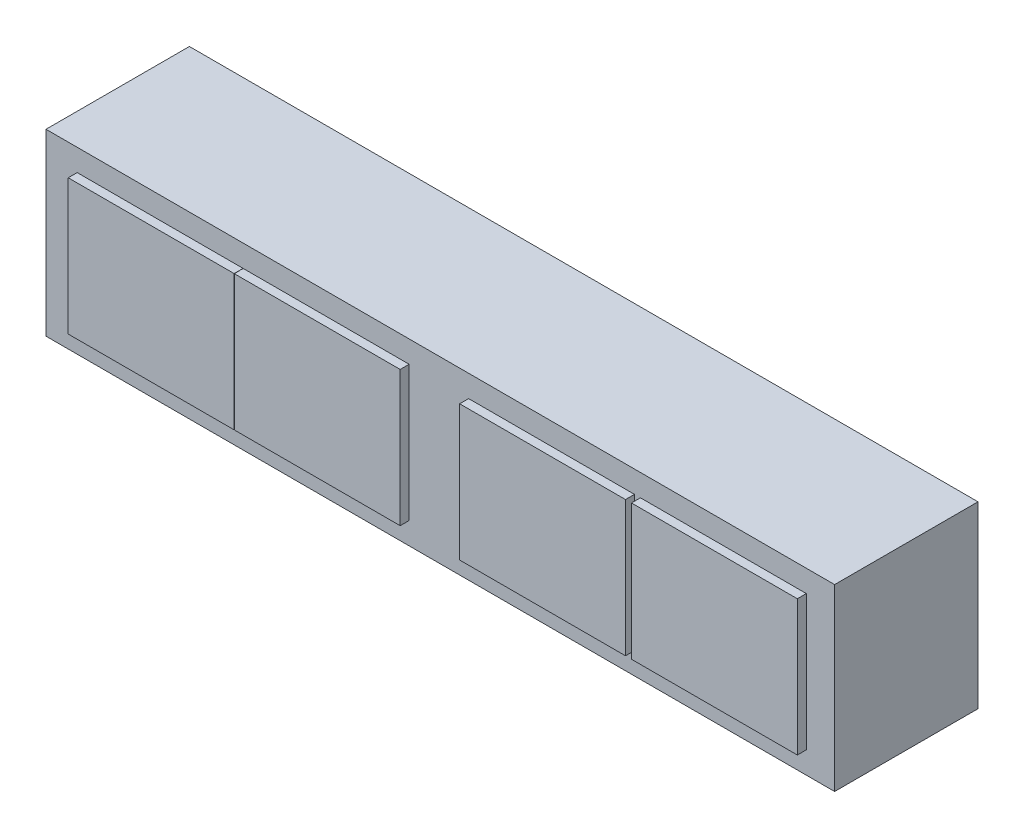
ISO-10303-21;
HEADER;
FILE_DESCRIPTION(('STEP AP214'),'2;1');
FILE_NAME('part.step','',(''),(''),'','','');
FILE_SCHEMA(('AUTOMOTIVE_DESIGN { 1 0 10303 214 1 1 1 1 }'));
ENDSEC;
DATA;
#1=APPLICATION_CONTEXT('core data for automotive mechanical design processes');
#2=APPLICATION_PROTOCOL_DEFINITION('international standard','automotive_design',2000,#1);
#3=PRODUCT_CONTEXT('',#1,'mechanical');
#4=PRODUCT('Part','Part','',(#3));
#5=PRODUCT_RELATED_PRODUCT_CATEGORY('part','',(#4));
#6=PRODUCT_DEFINITION_FORMATION('','',#4);
#7=PRODUCT_DEFINITION_CONTEXT('part definition',#1,'design');
#8=PRODUCT_DEFINITION('design','',#6,#7);
#9=PRODUCT_DEFINITION_SHAPE('','',#8);
#10=(LENGTH_UNIT() NAMED_UNIT(*) SI_UNIT(.MILLI.,.METRE.));
#11=(NAMED_UNIT(*) PLANE_ANGLE_UNIT() SI_UNIT($,.RADIAN.));
#12=(NAMED_UNIT(*) SI_UNIT($,.STERADIAN.) SOLID_ANGLE_UNIT());
#13=UNCERTAINTY_MEASURE_WITH_UNIT(LENGTH_MEASURE(1.E-05),#10,'distance_accuracy_value','');
#14=(GEOMETRIC_REPRESENTATION_CONTEXT(3) GLOBAL_UNCERTAINTY_ASSIGNED_CONTEXT((#13)) GLOBAL_UNIT_ASSIGNED_CONTEXT((#10,
#11,#12)) REPRESENTATION_CONTEXT('',''));
#15=CARTESIAN_POINT('',(0.,0.,0.));
#16=DIRECTION('',(0.,0.,1.));
#17=DIRECTION('',(1.,0.,0.));
#18=AXIS2_PLACEMENT_3D('',#15,#16,#17);
#19=CARTESIAN_POINT('',(0.,381.,304.8));
#20=DIRECTION('',(0.,0.,-1.));
#21=DIRECTION('',(-1.,0.,0.));
#22=AXIS2_PLACEMENT_3D('',#19,#20,#21);
#23=PLANE('',#22);
#24=DIRECTION('',(0.,-1.,0.));
#25=VECTOR('',#24,1.);
#26=CARTESIAN_POINT('',(898.397390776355,334.352318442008,304.8));
#27=LINE('',#26,#25);
#28=CARTESIAN_POINT('',(898.397390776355,334.352318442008,304.8));
#29=VERTEX_POINT('',#28);
#30=CARTESIAN_POINT('',(898.397390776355,46.637208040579,304.8));
#31=VERTEX_POINT('',#30);
#32=EDGE_CURVE('E193',#29,#31,#27,.T.);
#33=ORIENTED_EDGE('',*,*,#32,.F.);
#34=DIRECTION('',(-1.,0.,0.));
#35=VECTOR('',#34,1.);
#36=CARTESIAN_POINT('',(898.397390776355,334.352318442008,304.8));
#37=LINE('',#36,#35);
#38=CARTESIAN_POINT('',(1250.95,334.352318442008,304.8));
#39=VERTEX_POINT('',#38);
#40=EDGE_CURVE('E206',#39,#29,#37,.T.);
#41=ORIENTED_EDGE('',*,*,#40,.F.);
#42=DIRECTION('',(0.,1.,0.));
#43=VECTOR('',#42,1.);
#44=CARTESIAN_POINT('',(1250.95,334.352318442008,304.8));
#45=LINE('',#44,#43);
#46=CARTESIAN_POINT('',(1250.95,46.637208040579,304.8));
#47=VERTEX_POINT('',#46);
#48=EDGE_CURVE('E215',#47,#39,#45,.T.);
#49=ORIENTED_EDGE('',*,*,#48,.F.);
#50=DIRECTION('',(1.,0.,0.));
#51=VECTOR('',#50,1.);
#52=CARTESIAN_POINT('',(898.397390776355,46.637208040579,304.8));
#53=LINE('',#52,#51);
#54=EDGE_CURVE('E196',#31,#47,#53,.T.);
#55=ORIENTED_EDGE('',*,*,#54,.F.);
#56=EDGE_LOOP('',(#33,#41,#49,#55));
#57=FACE_BOUND('',#56,.T.);
#58=DIRECTION('',(0.,-1.,0.));
#59=VECTOR('',#58,1.);
#60=CARTESIAN_POINT('',(419.35,334.352318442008,304.8));
#61=LINE('',#60,#59);
#62=CARTESIAN_POINT('',(419.35,334.352318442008,304.8));
#63=VERTEX_POINT('',#62);
#64=CARTESIAN_POINT('',(419.35,46.637208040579,304.8));
#65=VERTEX_POINT('',#64);
#66=EDGE_CURVE('E264',#63,#65,#61,.T.);
#67=ORIENTED_EDGE('',*,*,#66,.F.);
#68=DIRECTION('',(-1.,0.,0.));
#69=VECTOR('',#68,1.);
#70=CARTESIAN_POINT('',(419.35,334.352318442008,304.8));
#71=LINE('',#70,#69);
#72=CARTESIAN_POINT('',(771.902609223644,334.352318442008,304.8));
#73=VERTEX_POINT('',#72);
#74=EDGE_CURVE('E269',#73,#63,#71,.T.);
#75=ORIENTED_EDGE('',*,*,#74,.F.);
#76=DIRECTION('',(0.,1.,0.));
#77=VECTOR('',#76,1.);
#78=CARTESIAN_POINT('',(771.902609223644,334.352318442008,304.8));
#79=LINE('',#78,#77);
#80=CARTESIAN_POINT('',(771.902609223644,46.637208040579,304.8));
#81=VERTEX_POINT('',#80);
#82=EDGE_CURVE('E281',#81,#73,#79,.T.);
#83=ORIENTED_EDGE('',*,*,#82,.F.);
#84=DIRECTION('',(1.,0.,0.));
#85=VECTOR('',#84,1.);
#86=CARTESIAN_POINT('',(419.35,46.637208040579,304.8));
#87=LINE('',#86,#85);
#88=EDGE_CURVE('E278',#65,#81,#87,.T.);
#89=ORIENTED_EDGE('',*,*,#88,.F.);
#90=EDGE_LOOP('',(#67,#75,#83,#89));
#91=FACE_BOUND('',#90,.T.);
#92=DIRECTION('',(0.,-1.,0.));
#93=VECTOR('',#92,1.);
#94=CARTESIAN_POINT('',(0.,0.,304.8));
#95=LINE('',#94,#93);
#96=CARTESIAN_POINT('',(0.,381.,304.8));
#97=VERTEX_POINT('',#96);
#98=CARTESIAN_POINT('',(0.,0.,304.8));
#99=VERTEX_POINT('',#98);
#100=EDGE_CURVE('E298',#97,#99,#95,.T.);
#101=ORIENTED_EDGE('',*,*,#100,.T.);
#102=DIRECTION('',(1.,0.,0.));
#103=VECTOR('',#102,1.);
#104=CARTESIAN_POINT('',(0.,0.,304.8));
#105=LINE('',#104,#103);
#106=CARTESIAN_POINT('',(1676.4,0.,304.8));
#107=VERTEX_POINT('',#106);
#108=EDGE_CURVE('E301',#99,#107,#105,.T.);
#109=ORIENTED_EDGE('',*,*,#108,.T.);
#110=DIRECTION('',(0.,1.,0.));
#111=VECTOR('',#110,1.);
#112=CARTESIAN_POINT('',(1676.4,0.,304.8));
#113=LINE('',#112,#111);
#114=CARTESIAN_POINT('',(1676.4,381.,304.8));
#115=VERTEX_POINT('',#114);
#116=EDGE_CURVE('E304',#107,#115,#113,.T.);
#117=ORIENTED_EDGE('',*,*,#116,.T.);
#118=DIRECTION('',(-1.,0.,0.));
#119=VECTOR('',#118,1.);
#120=CARTESIAN_POINT('',(0.,381.,304.8));
#121=LINE('',#120,#119);
#122=EDGE_CURVE('E306',#115,#97,#121,.T.);
#123=ORIENTED_EDGE('',*,*,#122,.T.);
#124=EDGE_LOOP('',(#101,#109,#117,#123));
#125=FACE_BOUND('',#124,.T.);
#126=DIRECTION('',(0.,-1.,0.));
#127=VECTOR('',#126,1.);
#128=CARTESIAN_POINT('',(66.2973907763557,334.352318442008,304.8));
#129=LINE('',#128,#127);
#130=CARTESIAN_POINT('',(66.2973907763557,334.352318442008,304.8));
#131=VERTEX_POINT('',#130);
#132=CARTESIAN_POINT('',(66.2973907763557,46.637208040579,304.8));
#133=VERTEX_POINT('',#132);
#134=EDGE_CURVE('E231',#131,#133,#129,.T.);
#135=ORIENTED_EDGE('',*,*,#134,.F.);
#136=DIRECTION('',(-1.,0.,0.));
#137=VECTOR('',#136,1.);
#138=CARTESIAN_POINT('',(66.2973907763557,334.352318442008,304.8));
#139=LINE('',#138,#137);
#140=CARTESIAN_POINT('',(418.85,334.352318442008,304.8));
#141=VERTEX_POINT('',#140);
#142=EDGE_CURVE('E236',#141,#131,#139,.T.);
#143=ORIENTED_EDGE('',*,*,#142,.F.);
#144=DIRECTION('',(0.,1.,0.));
#145=VECTOR('',#144,1.);
#146=CARTESIAN_POINT('',(418.85,334.352318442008,304.8));
#147=LINE('',#146,#145);
#148=CARTESIAN_POINT('',(418.85,46.637208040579,304.8));
#149=VERTEX_POINT('',#148);
#150=EDGE_CURVE('E248',#149,#141,#147,.T.);
#151=ORIENTED_EDGE('',*,*,#150,.F.);
#152=DIRECTION('',(1.,0.,0.));
#153=VECTOR('',#152,1.);
#154=CARTESIAN_POINT('',(66.2973907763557,46.637208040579,304.8));
#155=LINE('',#154,#153);
#156=EDGE_CURVE('E245',#133,#149,#155,.T.);
#157=ORIENTED_EDGE('',*,*,#156,.F.);
#158=EDGE_LOOP('',(#135,#143,#151,#157));
#159=FACE_BOUND('',#158,.T.);
#160=DIRECTION('',(0.,-1.,0.));
#161=VECTOR('',#160,1.);
#162=CARTESIAN_POINT('',(1263.65,334.352318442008,304.8));
#163=LINE('',#162,#161);
#164=CARTESIAN_POINT('',(1263.65,334.352318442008,304.8));
#165=VERTEX_POINT('',#164);
#166=CARTESIAN_POINT('',(1263.65,46.637208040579,304.8));
#167=VERTEX_POINT('',#166);
#168=EDGE_CURVE('E192',#165,#167,#163,.T.);
#169=ORIENTED_EDGE('',*,*,#168,.F.);
#170=DIRECTION('',(-1.,0.,0.));
#171=VECTOR('',#170,1.);
#172=CARTESIAN_POINT('',(1263.65,334.352318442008,304.8));
#173=LINE('',#172,#171);
#174=CARTESIAN_POINT('',(1616.20260922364,334.352318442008,304.8));
#175=VERTEX_POINT('',#174);
#176=EDGE_CURVE('E189',#175,#165,#173,.T.);
#177=ORIENTED_EDGE('',*,*,#176,.F.);
#178=DIRECTION('',(0.,1.,0.));
#179=VECTOR('',#178,1.);
#180=CARTESIAN_POINT('',(1616.20260922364,334.352318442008,304.8));
#181=LINE('',#180,#179);
#182=CARTESIAN_POINT('',(1616.20260922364,46.637208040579,304.8));
#183=VERTEX_POINT('',#182);
#184=EDGE_CURVE('E55',#183,#175,#181,.T.);
#185=ORIENTED_EDGE('',*,*,#184,.F.);
#186=DIRECTION('',(1.,0.,0.));
#187=VECTOR('',#186,1.);
#188=CARTESIAN_POINT('',(1263.65,46.637208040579,304.8));
#189=LINE('',#188,#187);
#190=EDGE_CURVE('E50',#167,#183,#189,.T.);
#191=ORIENTED_EDGE('',*,*,#190,.F.);
#192=EDGE_LOOP('',(#169,#177,#185,#191));
#193=FACE_BOUND('',#192,.T.);
#194=ADVANCED_FACE('F35',(#57,#91,#125,#159,#193),#23,.F.);
#195=CARTESIAN_POINT('',(0.,0.,304.8));
#196=DIRECTION('',(1.,0.,0.));
#197=DIRECTION('',(0.,0.,-1.));
#198=AXIS2_PLACEMENT_3D('',#195,#196,#197);
#199=PLANE('',#198);
#200=DIRECTION('',(0.,-1.,0.));
#201=VECTOR('',#200,1.);
#202=CARTESIAN_POINT('',(0.,0.,0.));
#203=LINE('',#202,#201);
#204=CARTESIAN_POINT('',(0.,381.,0.));
#205=VERTEX_POINT('',#204);
#206=CARTESIAN_POINT('',(0.,0.,0.));
#207=VERTEX_POINT('',#206);
#208=EDGE_CURVE('E297',#205,#207,#203,.T.);
#209=ORIENTED_EDGE('',*,*,#208,.T.);
#210=DIRECTION('',(0.,0.,-1.));
#211=VECTOR('',#210,1.);
#212=CARTESIAN_POINT('',(0.,0.,304.8));
#213=LINE('',#212,#211);
#214=EDGE_CURVE('E11',#99,#207,#213,.T.);
#215=ORIENTED_EDGE('',*,*,#214,.F.);
#216=ORIENTED_EDGE('',*,*,#100,.F.);
#217=DIRECTION('',(0.,0.,-1.));
#218=VECTOR('',#217,1.);
#219=CARTESIAN_POINT('',(0.,381.,304.8));
#220=LINE('',#219,#218);
#221=EDGE_CURVE('E308',#97,#205,#220,.T.);
#222=ORIENTED_EDGE('',*,*,#221,.T.);
#223=EDGE_LOOP('',(#209,#215,#216,#222));
#224=FACE_BOUND('',#223,.T.);
#225=ADVANCED_FACE('F37',(#224),#199,.F.);
#226=CARTESIAN_POINT('',(0.,0.,304.8));
#227=DIRECTION('',(0.,1.,0.));
#228=DIRECTION('',(0.,0.,1.));
#229=AXIS2_PLACEMENT_3D('',#226,#227,#228);
#230=PLANE('',#229);
#231=DIRECTION('',(1.,0.,0.));
#232=VECTOR('',#231,1.);
#233=CARTESIAN_POINT('',(0.,0.,0.));
#234=LINE('',#233,#232);
#235=CARTESIAN_POINT('',(1676.4,0.,0.));
#236=VERTEX_POINT('',#235);
#237=EDGE_CURVE('E311',#207,#236,#234,.T.);
#238=ORIENTED_EDGE('',*,*,#237,.T.);
#239=DIRECTION('',(0.,0.,-1.));
#240=VECTOR('',#239,1.);
#241=CARTESIAN_POINT('',(1676.4,0.,304.8));
#242=LINE('',#241,#240);
#243=EDGE_CURVE('E43',#107,#236,#242,.T.);
#244=ORIENTED_EDGE('',*,*,#243,.F.);
#245=ORIENTED_EDGE('',*,*,#108,.F.);
#246=ORIENTED_EDGE('',*,*,#214,.T.);
#247=EDGE_LOOP('',(#238,#244,#245,#246));
#248=FACE_BOUND('',#247,.T.);
#249=ADVANCED_FACE('F341',(#248),#230,.F.);
#250=CARTESIAN_POINT('',(1676.4,0.,304.8));
#251=DIRECTION('',(-1.,0.,0.));
#252=DIRECTION('',(0.,0.,1.));
#253=AXIS2_PLACEMENT_3D('',#250,#251,#252);
#254=PLANE('',#253);
#255=DIRECTION('',(0.,1.,0.));
#256=VECTOR('',#255,1.);
#257=CARTESIAN_POINT('',(1676.4,0.,0.));
#258=LINE('',#257,#256);
#259=CARTESIAN_POINT('',(1676.4,381.,0.));
#260=VERTEX_POINT('',#259);
#261=EDGE_CURVE('E313',#236,#260,#258,.T.);
#262=ORIENTED_EDGE('',*,*,#261,.T.);
#263=DIRECTION('',(0.,0.,-1.));
#264=VECTOR('',#263,1.);
#265=CARTESIAN_POINT('',(1676.4,381.,304.8));
#266=LINE('',#265,#264);
#267=EDGE_CURVE('E318',#115,#260,#266,.T.);
#268=ORIENTED_EDGE('',*,*,#267,.F.);
#269=ORIENTED_EDGE('',*,*,#116,.F.);
#270=ORIENTED_EDGE('',*,*,#243,.T.);
#271=EDGE_LOOP('',(#262,#268,#269,#270));
#272=FACE_BOUND('',#271,.T.);
#273=ADVANCED_FACE('F325',(#272),#254,.F.);
#274=CARTESIAN_POINT('',(0.,381.,304.8));
#275=DIRECTION('',(0.,-1.,0.));
#276=DIRECTION('',(0.,0.,-1.));
#277=AXIS2_PLACEMENT_3D('',#274,#275,#276);
#278=PLANE('',#277);
#279=DIRECTION('',(-1.,0.,0.));
#280=VECTOR('',#279,1.);
#281=CARTESIAN_POINT('',(0.,381.,0.));
#282=LINE('',#281,#280);
#283=EDGE_CURVE('E302',#260,#205,#282,.T.);
#284=ORIENTED_EDGE('',*,*,#283,.T.);
#285=ORIENTED_EDGE('',*,*,#221,.F.);
#286=ORIENTED_EDGE('',*,*,#122,.F.);
#287=ORIENTED_EDGE('',*,*,#267,.T.);
#288=EDGE_LOOP('',(#284,#285,#286,#287));
#289=FACE_BOUND('',#288,.T.);
#290=ADVANCED_FACE('F334',(#289),#278,.F.);
#291=CARTESIAN_POINT('',(0.,381.,0.));
#292=DIRECTION('',(0.,0.,-1.));
#293=DIRECTION('',(-1.,0.,0.));
#294=AXIS2_PLACEMENT_3D('',#291,#292,#293);
#295=PLANE('',#294);
#296=ORIENTED_EDGE('',*,*,#208,.F.);
#297=ORIENTED_EDGE('',*,*,#283,.F.);
#298=ORIENTED_EDGE('',*,*,#261,.F.);
#299=ORIENTED_EDGE('',*,*,#237,.F.);
#300=EDGE_LOOP('',(#296,#297,#298,#299));
#301=FACE_BOUND('',#300,.T.);
#302=ADVANCED_FACE('F331',(#301),#295,.T.);
#303=CARTESIAN_POINT('',(419.35,334.352318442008,323.85));
#304=DIRECTION('',(1.,0.,0.));
#305=DIRECTION('',(0.,0.,-1.));
#306=AXIS2_PLACEMENT_3D('',#303,#304,#305);
#307=PLANE('',#306);
#308=ORIENTED_EDGE('',*,*,#66,.T.);
#309=DIRECTION('',(0.,0.,-1.));
#310=VECTOR('',#309,1.);
#311=CARTESIAN_POINT('',(419.35,46.637208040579,323.85));
#312=LINE('',#311,#310);
#313=CARTESIAN_POINT('',(419.35,46.637208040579,323.85));
#314=VERTEX_POINT('',#313);
#315=EDGE_CURVE('E294',#314,#65,#312,.T.);
#316=ORIENTED_EDGE('',*,*,#315,.F.);
#317=DIRECTION('',(0.,-1.,0.));
#318=VECTOR('',#317,1.);
#319=CARTESIAN_POINT('',(419.35,334.352318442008,323.85));
#320=LINE('',#319,#318);
#321=CARTESIAN_POINT('',(419.35,334.352318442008,323.85));
#322=VERTEX_POINT('',#321);
#323=EDGE_CURVE('E265',#322,#314,#320,.T.);
#324=ORIENTED_EDGE('',*,*,#323,.F.);
#325=DIRECTION('',(0.,0.,-1.));
#326=VECTOR('',#325,1.);
#327=CARTESIAN_POINT('',(419.35,334.352318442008,323.85));
#328=LINE('',#327,#326);
#329=EDGE_CURVE('E275',#322,#63,#328,.T.);
#330=ORIENTED_EDGE('',*,*,#329,.T.);
#331=EDGE_LOOP('',(#308,#316,#324,#330));
#332=FACE_BOUND('',#331,.T.);
#333=ADVANCED_FACE('F356',(#332),#307,.F.);
#334=CARTESIAN_POINT('',(419.35,46.637208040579,323.85));
#335=DIRECTION('',(0.,1.,0.));
#336=DIRECTION('',(0.,0.,1.));
#337=AXIS2_PLACEMENT_3D('',#334,#335,#336);
#338=PLANE('',#337);
#339=ORIENTED_EDGE('',*,*,#88,.T.);
#340=DIRECTION('',(0.,0.,-1.));
#341=VECTOR('',#340,1.);
#342=CARTESIAN_POINT('',(771.902609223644,46.637208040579,323.85));
#343=LINE('',#342,#341);
#344=CARTESIAN_POINT('',(771.902609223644,46.637208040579,323.85));
#345=VERTEX_POINT('',#344);
#346=EDGE_CURVE('E291',#345,#81,#343,.T.);
#347=ORIENTED_EDGE('',*,*,#346,.F.);
#348=DIRECTION('',(1.,0.,0.));
#349=VECTOR('',#348,1.);
#350=CARTESIAN_POINT('',(419.35,46.637208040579,323.85));
#351=LINE('',#350,#349);
#352=EDGE_CURVE('E268',#314,#345,#351,.T.);
#353=ORIENTED_EDGE('',*,*,#352,.F.);
#354=ORIENTED_EDGE('',*,*,#315,.T.);
#355=EDGE_LOOP('',(#339,#347,#353,#354));
#356=FACE_BOUND('',#355,.T.);
#357=ADVANCED_FACE('F376',(#356),#338,.F.);
#358=CARTESIAN_POINT('',(771.902609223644,334.352318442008,323.85));
#359=DIRECTION('',(-1.,0.,0.));
#360=DIRECTION('',(0.,0.,1.));
#361=AXIS2_PLACEMENT_3D('',#358,#359,#360);
#362=PLANE('',#361);
#363=ORIENTED_EDGE('',*,*,#82,.T.);
#364=DIRECTION('',(0.,0.,-1.));
#365=VECTOR('',#364,1.);
#366=CARTESIAN_POINT('',(771.902609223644,334.352318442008,323.85));
#367=LINE('',#366,#365);
#368=CARTESIAN_POINT('',(771.902609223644,334.352318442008,323.85));
#369=VERTEX_POINT('',#368);
#370=EDGE_CURVE('E288',#369,#73,#367,.T.);
#371=ORIENTED_EDGE('',*,*,#370,.F.);
#372=DIRECTION('',(0.,1.,0.));
#373=VECTOR('',#372,1.);
#374=CARTESIAN_POINT('',(771.902609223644,334.352318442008,323.85));
#375=LINE('',#374,#373);
#376=EDGE_CURVE('E271',#345,#369,#375,.T.);
#377=ORIENTED_EDGE('',*,*,#376,.F.);
#378=ORIENTED_EDGE('',*,*,#346,.T.);
#379=EDGE_LOOP('',(#363,#371,#377,#378));
#380=FACE_BOUND('',#379,.T.);
#381=ADVANCED_FACE('F383',(#380),#362,.F.);
#382=CARTESIAN_POINT('',(419.35,334.352318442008,323.85));
#383=DIRECTION('',(0.,-1.,0.));
#384=DIRECTION('',(0.,0.,-1.));
#385=AXIS2_PLACEMENT_3D('',#382,#383,#384);
#386=PLANE('',#385);
#387=ORIENTED_EDGE('',*,*,#74,.T.);
#388=ORIENTED_EDGE('',*,*,#329,.F.);
#389=DIRECTION('',(-1.,0.,0.));
#390=VECTOR('',#389,1.);
#391=CARTESIAN_POINT('',(419.35,334.352318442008,323.85));
#392=LINE('',#391,#390);
#393=EDGE_CURVE('E273',#369,#322,#392,.T.);
#394=ORIENTED_EDGE('',*,*,#393,.F.);
#395=ORIENTED_EDGE('',*,*,#370,.T.);
#396=EDGE_LOOP('',(#387,#388,#394,#395));
#397=FACE_BOUND('',#396,.T.);
#398=ADVANCED_FACE('F390',(#397),#386,.F.);
#399=CARTESIAN_POINT('',(419.35,46.637208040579,323.85));
#400=DIRECTION('',(0.,0.,1.));
#401=DIRECTION('',(1.,0.,0.));
#402=AXIS2_PLACEMENT_3D('',#399,#400,#401);
#403=PLANE('',#402);
#404=ORIENTED_EDGE('',*,*,#323,.T.);
#405=ORIENTED_EDGE('',*,*,#352,.T.);
#406=ORIENTED_EDGE('',*,*,#376,.T.);
#407=ORIENTED_EDGE('',*,*,#393,.T.);
#408=EDGE_LOOP('',(#404,#405,#406,#407));
#409=FACE_BOUND('',#408,.T.);
#410=ADVANCED_FACE('F398',(#409),#403,.T.);
#411=CARTESIAN_POINT('',(66.2973907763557,334.352318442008,323.85));
#412=DIRECTION('',(1.,0.,0.));
#413=DIRECTION('',(0.,0.,-1.));
#414=AXIS2_PLACEMENT_3D('',#411,#412,#413);
#415=PLANE('',#414);
#416=ORIENTED_EDGE('',*,*,#134,.T.);
#417=DIRECTION('',(0.,0.,-1.));
#418=VECTOR('',#417,1.);
#419=CARTESIAN_POINT('',(66.2973907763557,46.637208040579,323.85));
#420=LINE('',#419,#418);
#421=CARTESIAN_POINT('',(66.2973907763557,46.637208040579,323.85));
#422=VERTEX_POINT('',#421);
#423=EDGE_CURVE('E261',#422,#133,#420,.T.);
#424=ORIENTED_EDGE('',*,*,#423,.F.);
#425=DIRECTION('',(0.,-1.,0.));
#426=VECTOR('',#425,1.);
#427=CARTESIAN_POINT('',(66.2973907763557,334.352318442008,323.85));
#428=LINE('',#427,#426);
#429=CARTESIAN_POINT('',(66.2973907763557,334.352318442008,323.85));
#430=VERTEX_POINT('',#429);
#431=EDGE_CURVE('E232',#430,#422,#428,.T.);
#432=ORIENTED_EDGE('',*,*,#431,.F.);
#433=DIRECTION('',(0.,0.,-1.));
#434=VECTOR('',#433,1.);
#435=CARTESIAN_POINT('',(66.2973907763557,334.352318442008,323.85));
#436=LINE('',#435,#434);
#437=EDGE_CURVE('E242',#430,#131,#436,.T.);
#438=ORIENTED_EDGE('',*,*,#437,.T.);
#439=EDGE_LOOP('',(#416,#424,#432,#438));
#440=FACE_BOUND('',#439,.T.);
#441=ADVANCED_FACE('F406',(#440),#415,.F.);
#442=CARTESIAN_POINT('',(66.2973907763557,46.637208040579,323.85));
#443=DIRECTION('',(0.,1.,0.));
#444=DIRECTION('',(0.,0.,1.));
#445=AXIS2_PLACEMENT_3D('',#442,#443,#444);
#446=PLANE('',#445);
#447=ORIENTED_EDGE('',*,*,#156,.T.);
#448=DIRECTION('',(0.,0.,-1.));
#449=VECTOR('',#448,1.);
#450=CARTESIAN_POINT('',(418.85,46.637208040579,323.85));
#451=LINE('',#450,#449);
#452=CARTESIAN_POINT('',(418.85,46.637208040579,323.85));
#453=VERTEX_POINT('',#452);
#454=EDGE_CURVE('E258',#453,#149,#451,.T.);
#455=ORIENTED_EDGE('',*,*,#454,.F.);
#456=DIRECTION('',(1.,0.,0.));
#457=VECTOR('',#456,1.);
#458=CARTESIAN_POINT('',(66.2973907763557,46.637208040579,323.85));
#459=LINE('',#458,#457);
#460=EDGE_CURVE('E235',#422,#453,#459,.T.);
#461=ORIENTED_EDGE('',*,*,#460,.F.);
#462=ORIENTED_EDGE('',*,*,#423,.T.);
#463=EDGE_LOOP('',(#447,#455,#461,#462));
#464=FACE_BOUND('',#463,.T.);
#465=ADVANCED_FACE('F414',(#464),#446,.F.);
#466=CARTESIAN_POINT('',(418.85,334.352318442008,323.85));
#467=DIRECTION('',(-1.,0.,0.));
#468=DIRECTION('',(0.,0.,1.));
#469=AXIS2_PLACEMENT_3D('',#466,#467,#468);
#470=PLANE('',#469);
#471=ORIENTED_EDGE('',*,*,#150,.T.);
#472=DIRECTION('',(0.,0.,-1.));
#473=VECTOR('',#472,1.);
#474=CARTESIAN_POINT('',(418.85,334.352318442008,323.85));
#475=LINE('',#474,#473);
#476=CARTESIAN_POINT('',(418.85,334.352318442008,323.85));
#477=VERTEX_POINT('',#476);
#478=EDGE_CURVE('E255',#477,#141,#475,.T.);
#479=ORIENTED_EDGE('',*,*,#478,.F.);
#480=DIRECTION('',(0.,1.,0.));
#481=VECTOR('',#480,1.);
#482=CARTESIAN_POINT('',(418.85,334.352318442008,323.85));
#483=LINE('',#482,#481);
#484=EDGE_CURVE('E238',#453,#477,#483,.T.);
#485=ORIENTED_EDGE('',*,*,#484,.F.);
#486=ORIENTED_EDGE('',*,*,#454,.T.);
#487=EDGE_LOOP('',(#471,#479,#485,#486));
#488=FACE_BOUND('',#487,.T.);
#489=ADVANCED_FACE('F422',(#488),#470,.F.);
#490=CARTESIAN_POINT('',(66.2973907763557,334.352318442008,323.85));
#491=DIRECTION('',(0.,-1.,0.));
#492=DIRECTION('',(0.,0.,-1.));
#493=AXIS2_PLACEMENT_3D('',#490,#491,#492);
#494=PLANE('',#493);
#495=ORIENTED_EDGE('',*,*,#142,.T.);
#496=ORIENTED_EDGE('',*,*,#437,.F.);
#497=DIRECTION('',(-1.,0.,0.));
#498=VECTOR('',#497,1.);
#499=CARTESIAN_POINT('',(66.2973907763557,334.352318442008,323.85));
#500=LINE('',#499,#498);
#501=EDGE_CURVE('E240',#477,#430,#500,.T.);
#502=ORIENTED_EDGE('',*,*,#501,.F.);
#503=ORIENTED_EDGE('',*,*,#478,.T.);
#504=EDGE_LOOP('',(#495,#496,#502,#503));
#505=FACE_BOUND('',#504,.T.);
#506=ADVANCED_FACE('F430',(#505),#494,.F.);
#507=CARTESIAN_POINT('',(66.2973907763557,46.637208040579,323.85));
#508=DIRECTION('',(0.,0.,1.));
#509=DIRECTION('',(1.,0.,0.));
#510=AXIS2_PLACEMENT_3D('',#507,#508,#509);
#511=PLANE('',#510);
#512=ORIENTED_EDGE('',*,*,#431,.T.);
#513=ORIENTED_EDGE('',*,*,#460,.T.);
#514=ORIENTED_EDGE('',*,*,#484,.T.);
#515=ORIENTED_EDGE('',*,*,#501,.T.);
#516=EDGE_LOOP('',(#512,#513,#514,#515));
#517=FACE_BOUND('',#516,.T.);
#518=ADVANCED_FACE('F438',(#517),#511,.T.);
#519=CARTESIAN_POINT('',(898.397390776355,334.352318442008,323.85));
#520=DIRECTION('',(1.,0.,0.));
#521=DIRECTION('',(0.,0.,-1.));
#522=AXIS2_PLACEMENT_3D('',#519,#520,#521);
#523=PLANE('',#522);
#524=ORIENTED_EDGE('',*,*,#32,.T.);
#525=DIRECTION('',(0.,0.,-1.));
#526=VECTOR('',#525,1.);
#527=CARTESIAN_POINT('',(898.397390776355,46.637208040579,323.85));
#528=LINE('',#527,#526);
#529=CARTESIAN_POINT('',(898.397390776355,46.637208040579,323.85));
#530=VERTEX_POINT('',#529);
#531=EDGE_CURVE('E228',#530,#31,#528,.T.);
#532=ORIENTED_EDGE('',*,*,#531,.F.);
#533=DIRECTION('',(0.,-1.,0.));
#534=VECTOR('',#533,1.);
#535=CARTESIAN_POINT('',(898.397390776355,334.352318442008,323.85));
#536=LINE('',#535,#534);
#537=CARTESIAN_POINT('',(898.397390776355,334.352318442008,323.85));
#538=VERTEX_POINT('',#537);
#539=EDGE_CURVE('E202',#538,#530,#536,.T.);
#540=ORIENTED_EDGE('',*,*,#539,.F.);
#541=DIRECTION('',(0.,0.,-1.));
#542=VECTOR('',#541,1.);
#543=CARTESIAN_POINT('',(898.397390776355,334.352318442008,323.85));
#544=LINE('',#543,#542);
#545=EDGE_CURVE('E211',#538,#29,#544,.T.);
#546=ORIENTED_EDGE('',*,*,#545,.T.);
#547=EDGE_LOOP('',(#524,#532,#540,#546));
#548=FACE_BOUND('',#547,.T.);
#549=ADVANCED_FACE('F446',(#548),#523,.F.);
#550=CARTESIAN_POINT('',(898.397390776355,46.637208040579,323.85));
#551=DIRECTION('',(0.,1.,0.));
#552=DIRECTION('',(0.,0.,1.));
#553=AXIS2_PLACEMENT_3D('',#550,#551,#552);
#554=PLANE('',#553);
#555=ORIENTED_EDGE('',*,*,#54,.T.);
#556=DIRECTION('',(0.,0.,-1.));
#557=VECTOR('',#556,1.);
#558=CARTESIAN_POINT('',(1250.95,46.637208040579,323.85));
#559=LINE('',#558,#557);
#560=CARTESIAN_POINT('',(1250.95,46.637208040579,323.85));
#561=VERTEX_POINT('',#560);
#562=EDGE_CURVE('E225',#561,#47,#559,.T.);
#563=ORIENTED_EDGE('',*,*,#562,.F.);
#564=DIRECTION('',(1.,0.,0.));
#565=VECTOR('',#564,1.);
#566=CARTESIAN_POINT('',(898.397390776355,46.637208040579,323.85));
#567=LINE('',#566,#565);
#568=EDGE_CURVE('E205',#530,#561,#567,.T.);
#569=ORIENTED_EDGE('',*,*,#568,.F.);
#570=ORIENTED_EDGE('',*,*,#531,.T.);
#571=EDGE_LOOP('',(#555,#563,#569,#570));
#572=FACE_BOUND('',#571,.T.);
#573=ADVANCED_FACE('F454',(#572),#554,.F.);
#574=CARTESIAN_POINT('',(1250.95,334.352318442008,323.85));
#575=DIRECTION('',(-1.,0.,0.));
#576=DIRECTION('',(0.,0.,1.));
#577=AXIS2_PLACEMENT_3D('',#574,#575,#576);
#578=PLANE('',#577);
#579=ORIENTED_EDGE('',*,*,#48,.T.);
#580=DIRECTION('',(0.,0.,-1.));
#581=VECTOR('',#580,1.);
#582=CARTESIAN_POINT('',(1250.95,334.352318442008,323.85));
#583=LINE('',#582,#581);
#584=CARTESIAN_POINT('',(1250.95,334.352318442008,323.85));
#585=VERTEX_POINT('',#584);
#586=EDGE_CURVE('E222',#585,#39,#583,.T.);
#587=ORIENTED_EDGE('',*,*,#586,.F.);
#588=DIRECTION('',(0.,1.,0.));
#589=VECTOR('',#588,1.);
#590=CARTESIAN_POINT('',(1250.95,334.352318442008,323.85));
#591=LINE('',#590,#589);
#592=EDGE_CURVE('E208',#561,#585,#591,.T.);
#593=ORIENTED_EDGE('',*,*,#592,.F.);
#594=ORIENTED_EDGE('',*,*,#562,.T.);
#595=EDGE_LOOP('',(#579,#587,#593,#594));
#596=FACE_BOUND('',#595,.T.);
#597=ADVANCED_FACE('F462',(#596),#578,.F.);
#598=CARTESIAN_POINT('',(898.397390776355,334.352318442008,323.85));
#599=DIRECTION('',(0.,-1.,0.));
#600=DIRECTION('',(0.,0.,-1.));
#601=AXIS2_PLACEMENT_3D('',#598,#599,#600);
#602=PLANE('',#601);
#603=ORIENTED_EDGE('',*,*,#40,.T.);
#604=ORIENTED_EDGE('',*,*,#545,.F.);
#605=DIRECTION('',(-1.,0.,0.));
#606=VECTOR('',#605,1.);
#607=CARTESIAN_POINT('',(898.397390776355,334.352318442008,323.85));
#608=LINE('',#607,#606);
#609=EDGE_CURVE('E210',#585,#538,#608,.T.);
#610=ORIENTED_EDGE('',*,*,#609,.F.);
#611=ORIENTED_EDGE('',*,*,#586,.T.);
#612=EDGE_LOOP('',(#603,#604,#610,#611));
#613=FACE_BOUND('',#612,.T.);
#614=ADVANCED_FACE('F470',(#613),#602,.F.);
#615=CARTESIAN_POINT('',(898.397390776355,46.637208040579,323.85));
#616=DIRECTION('',(0.,0.,1.));
#617=DIRECTION('',(1.,0.,0.));
#618=AXIS2_PLACEMENT_3D('',#615,#616,#617);
#619=PLANE('',#618);
#620=ORIENTED_EDGE('',*,*,#539,.T.);
#621=ORIENTED_EDGE('',*,*,#568,.T.);
#622=ORIENTED_EDGE('',*,*,#592,.T.);
#623=ORIENTED_EDGE('',*,*,#609,.T.);
#624=EDGE_LOOP('',(#620,#621,#622,#623));
#625=FACE_BOUND('',#624,.T.);
#626=ADVANCED_FACE('F478',(#625),#619,.T.);
#627=CARTESIAN_POINT('',(1263.65,334.352318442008,323.85));
#628=DIRECTION('',(1.,0.,0.));
#629=DIRECTION('',(0.,0.,-1.));
#630=AXIS2_PLACEMENT_3D('',#627,#628,#629);
#631=PLANE('',#630);
#632=ORIENTED_EDGE('',*,*,#168,.T.);
#633=DIRECTION('',(0.,0.,-1.));
#634=VECTOR('',#633,1.);
#635=CARTESIAN_POINT('',(1263.65,46.637208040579,323.85));
#636=LINE('',#635,#634);
#637=CARTESIAN_POINT('',(1263.65,46.637208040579,323.85));
#638=VERTEX_POINT('',#637);
#639=EDGE_CURVE('E173',#638,#167,#636,.T.);
#640=ORIENTED_EDGE('',*,*,#639,.F.);
#641=DIRECTION('',(0.,-1.,0.));
#642=VECTOR('',#641,1.);
#643=CARTESIAN_POINT('',(1263.65,334.352318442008,323.85));
#644=LINE('',#643,#642);
#645=CARTESIAN_POINT('',(1263.65,334.352318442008,323.85));
#646=VERTEX_POINT('',#645);
#647=EDGE_CURVE('E180',#646,#638,#644,.T.);
#648=ORIENTED_EDGE('',*,*,#647,.F.);
#649=DIRECTION('',(0.,0.,-1.));
#650=VECTOR('',#649,1.);
#651=CARTESIAN_POINT('',(1263.65,334.352318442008,323.85));
#652=LINE('',#651,#650);
#653=EDGE_CURVE('E588',#646,#165,#652,.T.);
#654=ORIENTED_EDGE('',*,*,#653,.T.);
#655=EDGE_LOOP('',(#632,#640,#648,#654));
#656=FACE_BOUND('',#655,.T.);
#657=ADVANCED_FACE('F191',(#656),#631,.F.);
#658=CARTESIAN_POINT('',(1263.65,46.637208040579,323.85));
#659=DIRECTION('',(0.,1.,0.));
#660=DIRECTION('',(0.,0.,1.));
#661=AXIS2_PLACEMENT_3D('',#658,#659,#660);
#662=PLANE('',#661);
#663=ORIENTED_EDGE('',*,*,#190,.T.);
#664=DIRECTION('',(0.,0.,-1.));
#665=VECTOR('',#664,1.);
#666=CARTESIAN_POINT('',(1616.20260922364,46.637208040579,323.85));
#667=LINE('',#666,#665);
#668=CARTESIAN_POINT('',(1616.20260922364,46.637208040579,323.85));
#669=VERTEX_POINT('',#668);
#670=EDGE_CURVE('E176',#669,#183,#667,.T.);
#671=ORIENTED_EDGE('',*,*,#670,.F.);
#672=DIRECTION('',(1.,0.,0.));
#673=VECTOR('',#672,1.);
#674=CARTESIAN_POINT('',(1263.65,46.637208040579,323.85));
#675=LINE('',#674,#673);
#676=EDGE_CURVE('E169',#638,#669,#675,.T.);
#677=ORIENTED_EDGE('',*,*,#676,.F.);
#678=ORIENTED_EDGE('',*,*,#639,.T.);
#679=EDGE_LOOP('',(#663,#671,#677,#678));
#680=FACE_BOUND('',#679,.T.);
#681=ADVANCED_FACE('F171',(#680),#662,.F.);
#682=CARTESIAN_POINT('',(1616.20260922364,334.352318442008,323.85));
#683=DIRECTION('',(-1.,0.,0.));
#684=DIRECTION('',(0.,0.,1.));
#685=AXIS2_PLACEMENT_3D('',#682,#683,#684);
#686=PLANE('',#685);
#687=ORIENTED_EDGE('',*,*,#184,.T.);
#688=DIRECTION('',(0.,0.,-1.));
#689=VECTOR('',#688,1.);
#690=CARTESIAN_POINT('',(1616.20260922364,334.352318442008,323.85));
#691=LINE('',#690,#689);
#692=CARTESIAN_POINT('',(1616.20260922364,334.352318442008,323.85));
#693=VERTEX_POINT('',#692);
#694=EDGE_CURVE('E198',#693,#175,#691,.T.);
#695=ORIENTED_EDGE('',*,*,#694,.F.);
#696=DIRECTION('',(0.,1.,0.));
#697=VECTOR('',#696,1.);
#698=CARTESIAN_POINT('',(1616.20260922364,334.352318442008,323.85));
#699=LINE('',#698,#697);
#700=EDGE_CURVE('E179',#669,#693,#699,.T.);
#701=ORIENTED_EDGE('',*,*,#700,.F.);
#702=ORIENTED_EDGE('',*,*,#670,.T.);
#703=EDGE_LOOP('',(#687,#695,#701,#702));
#704=FACE_BOUND('',#703,.T.);
#705=ADVANCED_FACE('F499',(#704),#686,.F.);
#706=CARTESIAN_POINT('',(1263.65,334.352318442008,323.85));
#707=DIRECTION('',(0.,-1.,0.));
#708=DIRECTION('',(0.,0.,-1.));
#709=AXIS2_PLACEMENT_3D('',#706,#707,#708);
#710=PLANE('',#709);
#711=ORIENTED_EDGE('',*,*,#176,.T.);
#712=ORIENTED_EDGE('',*,*,#653,.F.);
#713=DIRECTION('',(-1.,0.,0.));
#714=VECTOR('',#713,1.);
#715=CARTESIAN_POINT('',(1263.65,334.352318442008,323.85));
#716=LINE('',#715,#714);
#717=EDGE_CURVE('E185',#693,#646,#716,.T.);
#718=ORIENTED_EDGE('',*,*,#717,.F.);
#719=ORIENTED_EDGE('',*,*,#694,.T.);
#720=EDGE_LOOP('',(#711,#712,#718,#719));
#721=FACE_BOUND('',#720,.T.);
#722=ADVANCED_FACE('F506',(#721),#710,.F.);
#723=CARTESIAN_POINT('',(1263.65,46.637208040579,323.85));
#724=DIRECTION('',(0.,0.,1.));
#725=DIRECTION('',(1.,0.,0.));
#726=AXIS2_PLACEMENT_3D('',#723,#724,#725);
#727=PLANE('',#726);
#728=ORIENTED_EDGE('',*,*,#647,.T.);
#729=ORIENTED_EDGE('',*,*,#676,.T.);
#730=ORIENTED_EDGE('',*,*,#700,.T.);
#731=ORIENTED_EDGE('',*,*,#717,.T.);
#732=EDGE_LOOP('',(#728,#729,#730,#731));
#733=FACE_BOUND('',#732,.T.);
#734=ADVANCED_FACE('F183',(#733),#727,.T.);
#735=CLOSED_SHELL('',(#194,#225,#249,#273,#290,#302,#333,#357,#381,#398,#410,#441,#465,#489,
#506,#518,#549,#573,#597,#614,#626,#657,#681,#705,#722,#734));
#736=MANIFOLD_SOLID_BREP('B2',#735);
#737=ADVANCED_BREP_SHAPE_REPRESENTATION('',(#18,#736),#14);
#738=SHAPE_DEFINITION_REPRESENTATION(#9,#737);
ENDSEC;
END-ISO-10303-21;
